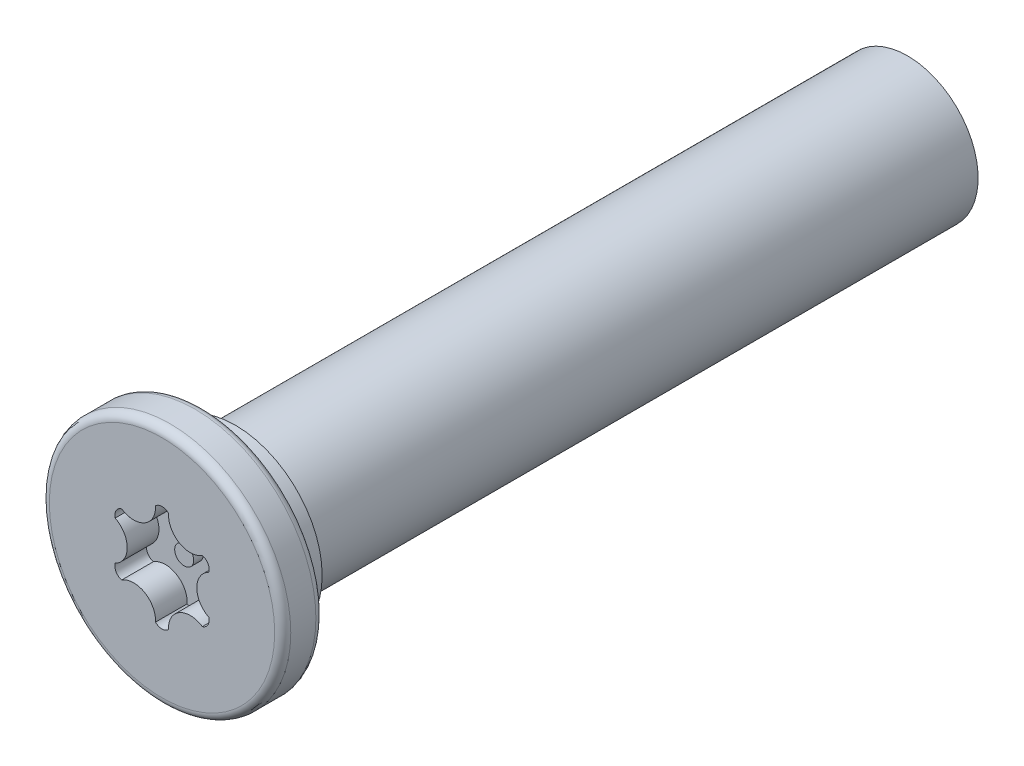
from build123d import *

# Parameters (mm, degrees)
SKETCH2_W           = 1.3
SKETCH2_H           = 3.81
SKETCH2_W_2         = 12.7
SKETCH2_H_2         = 2.23
CUT_EXTRUDE3_DEPTH  = 1
FILLET12_R          = 0.254
CUT_EXTRUDE6_START  = -12.7
SKETCH7_R           = 2.23
CUT_EXTRUDE6_DEPTH  = 12.7
SKETCH11_R          = 2.738000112
SKETCH11_R_2        = 2.230000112
BOSS_EXTRUDE1_DEPTH = 1.016
SKETCH12_R          = 2.230000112
BOSS_EXTRUDE2_DEPTH = 12.7
SKETCH14_R          = 0.3
BOSS_EXTRUDE4_DEPTH = 0.3
CUT_EXTRUDE7_START  = -12.7
SKETCH15_R          = 2.230000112
CUT_EXTRUDE7_DEPTH  = 12.7
SKETCH16_R          = 2.230000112
BOSS_EXTRUDE5_DEPTH = 22.225


with BuildPart() as part:
    # Sketch2 → Revolve1 (revolve)
    with BuildSketch(Plane(origin=(0, 0, 0), x_dir=(0, 0, -1), z_dir=(1, 0, 0)), mode=Mode.PRIVATE) as revolve1_sk:
        with Locations((0.65, 1.905)):
            Rectangle(SKETCH2_W, SKETCH2_H)
        with Locations((7.65, 1.115)):
            Rectangle(SKETCH2_W_2, SKETCH2_H_2)
    revolve(revolve1_sk.sketch.rotate(Axis((0, 0, -1.3), (0, 0, -1)), 90), axis=Axis((0, 0, -1.3), (0, 0, -1)))

    # Sketch3 → Cut-Extrude3 (cut)
    with BuildSketch(Plane.XY):
        with BuildLine():
            ThreePointArc((-0.205060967, 1.589373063), (0, 1.674312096), (0.205060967, 1.589373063))
            ThreePointArc((0.205060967, 1.589373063), (0.54882888, 0.950599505), (1.273906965, 0.972274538))
            ThreePointArc((1.273906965, 0.972274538), (1.449996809, 0.837156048), (1.478967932, 0.617098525))
            ThreePointArc((1.478967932, 0.617098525), (1.097657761, 0), (1.478967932, -0.617098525))
            ThreePointArc((1.478967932, -0.617098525), (1.449996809, -0.837156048), (1.273906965, -0.972274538))
            ThreePointArc((1.273906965, -0.972274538), (0.54882888, -0.950599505), (0.205060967, -1.589373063))
            ThreePointArc((0.205060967, -1.589373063), (0, -1.674312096), (-0.205060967, -1.589373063))
            ThreePointArc((-0.205060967, -1.589373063), (-0.54882888, -0.950599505), (-1.273906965, -0.972274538))
            ThreePointArc((-1.273906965, -0.972274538), (-1.449996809, -0.837156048), (-1.478967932, -0.617098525))
            ThreePointArc((-1.478967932, -0.617098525), (-1.097657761, 0), (-1.478967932, 0.617098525))
            ThreePointArc((-1.478967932, 0.617098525), (-1.449996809, 0.837156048), (-1.273906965, 0.972274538))
            ThreePointArc((-1.273906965, 0.972274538), (-0.54882888, 0.950599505), (-0.205060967, 1.589373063))
        make_face()
    extrude(amount=-CUT_EXTRUDE3_DEPTH, mode=Mode.SUBTRACT)

    # Fillet12
    fillet12_edges = [part.edges().sort_by_distance(p)[0] for p in [
        (-3.81, 0, 0),
        (-3.81, 0, -1.3),
    ]]
    fillet(fillet12_edges, radius=FILLET12_R)

    # Sketch7 → Cut-Extrude6 (cut)
    with BuildSketch(Plane(origin=(0, 0, -14), x_dir=(-1, 0, 0), z_dir=(0, 0, -1)).offset(CUT_EXTRUDE6_START)):
        Circle(SKETCH7_R)
    extrude(amount=CUT_EXTRUDE6_DEPTH, mode=Mode.SUBTRACT)

    # Sketch11 → Boss-Extrude1 (add)
    with BuildSketch(Plane(origin=(0, 0, -1.3), x_dir=(-1, 0, 0), z_dir=(0, 0, -1))):
        with Locations(Location((0, 0, 0), (0, 0, 180))):
            Circle(SKETCH11_R)
        Circle(SKETCH11_R_2, mode=Mode.SUBTRACT)
    extrude(amount=BOSS_EXTRUDE1_DEPTH)

    # Sketch12 → Boss-Extrude2 (add)
    with BuildSketch(Plane(origin=(0, 0, -1.3), x_dir=(-1, 0, 0), z_dir=(0, 0, -1))):
        Circle(SKETCH12_R)
    extrude(amount=BOSS_EXTRUDE2_DEPTH)

    # Sketch14 → Boss-Extrude4 (add)
    with BuildSketch(Plane.XY.offset(-1)):
        Circle(SKETCH14_R)
    extrude(amount=BOSS_EXTRUDE4_DEPTH)

    # Sketch15 → Cut-Extrude7 (cut)
    with BuildSketch(Plane(origin=(0, 0, -14), x_dir=(-1, 0, 0), z_dir=(0, 0, -1)).offset(CUT_EXTRUDE7_START)):
        Circle(SKETCH15_R)
    extrude(amount=CUT_EXTRUDE7_DEPTH, mode=Mode.SUBTRACT)

    # Sketch16 → Boss-Extrude5 (add)
    with BuildSketch(Plane(origin=(0, 0, -1.3), x_dir=(-1, 0, 0), z_dir=(0, 0, -1))):
        Circle(SKETCH16_R)
    extrude(amount=BOSS_EXTRUDE5_DEPTH)


solid = part.part
